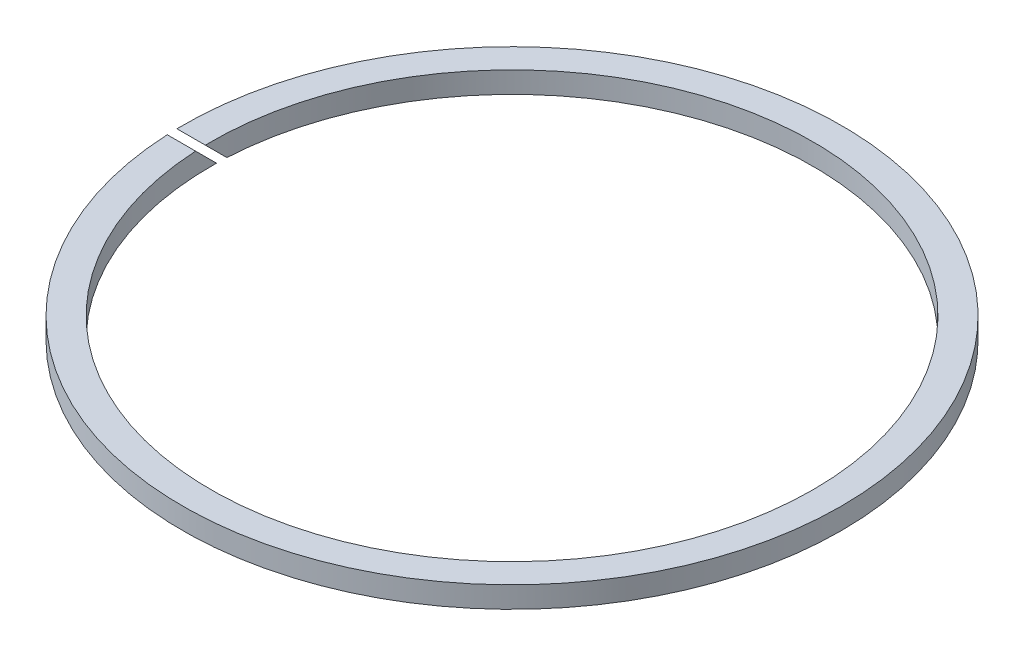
ISO-10303-21;
HEADER;
FILE_DESCRIPTION(('STEP AP214'),'2;1');
FILE_NAME('part.step','',(''),(''),'','','');
FILE_SCHEMA(('AUTOMOTIVE_DESIGN { 1 0 10303 214 1 1 1 1 }'));
ENDSEC;
DATA;
#1=APPLICATION_CONTEXT('core data for automotive mechanical design processes');
#2=APPLICATION_PROTOCOL_DEFINITION('international standard','automotive_design',2000,#1);
#3=PRODUCT_CONTEXT('',#1,'mechanical');
#4=PRODUCT('Part','Part','',(#3));
#5=PRODUCT_RELATED_PRODUCT_CATEGORY('part','',(#4));
#6=PRODUCT_DEFINITION_FORMATION('','',#4);
#7=PRODUCT_DEFINITION_CONTEXT('part definition',#1,'design');
#8=PRODUCT_DEFINITION('design','',#6,#7);
#9=PRODUCT_DEFINITION_SHAPE('','',#8);
#10=(LENGTH_UNIT() NAMED_UNIT(*) SI_UNIT(.MILLI.,.METRE.));
#11=(NAMED_UNIT(*) PLANE_ANGLE_UNIT() SI_UNIT($,.RADIAN.));
#12=(NAMED_UNIT(*) SI_UNIT($,.STERADIAN.) SOLID_ANGLE_UNIT());
#13=UNCERTAINTY_MEASURE_WITH_UNIT(LENGTH_MEASURE(1.E-05),#10,'distance_accuracy_value','');
#14=(GEOMETRIC_REPRESENTATION_CONTEXT(3) GLOBAL_UNCERTAINTY_ASSIGNED_CONTEXT((#13)) GLOBAL_UNIT_ASSIGNED_CONTEXT((#10,
#11,#12)) REPRESENTATION_CONTEXT('',''));
#15=CARTESIAN_POINT('',(0.,0.,0.));
#16=DIRECTION('',(0.,0.,1.));
#17=DIRECTION('',(1.,0.,0.));
#18=AXIS2_PLACEMENT_3D('',#15,#16,#17);
#19=CARTESIAN_POINT('',(0.,1.5,0.));
#20=DIRECTION('',(0.,1.,0.));
#21=DIRECTION('',(0.,0.,1.));
#22=AXIS2_PLACEMENT_3D('',#19,#20,#21);
#23=PLANE('',#22);
#24=DIRECTION('',(-1.,0.,0.));
#25=VECTOR('',#24,1.);
#26=CARTESIAN_POINT('',(-46.501,1.5,2.20710678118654));
#27=LINE('',#26,#25);
#28=CARTESIAN_POINT('',(-42.4426516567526,1.5,2.20710678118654));
#29=VERTEX_POINT('',#28);
#30=CARTESIAN_POINT('',(-46.4475906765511,1.5,2.20710678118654));
#31=VERTEX_POINT('',#30);
#32=EDGE_CURVE('E55',#29,#31,#27,.T.);
#33=ORIENTED_EDGE('',*,*,#32,.T.);
#34=CARTESIAN_POINT('',(0.,1.5,0.));
#35=DIRECTION('',(0.,1.,0.));
#36=DIRECTION('',(0.,0.,1.));
#37=AXIS2_PLACEMENT_3D('',#34,#35,#36);
#38=CIRCLE('',#37,46.5);
#39=CARTESIAN_POINT('',(-46.4932395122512,1.5,0.792893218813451));
#40=VERTEX_POINT('',#39);
#41=EDGE_CURVE('E11',#31,#40,#38,.T.);
#42=ORIENTED_EDGE('',*,*,#41,.T.);
#43=DIRECTION('',(1.,0.,0.));
#44=VECTOR('',#43,1.);
#45=CARTESIAN_POINT('',(-46.501,1.5,0.792893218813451));
#46=LINE('',#45,#44);
#47=CARTESIAN_POINT('',(-42.4926031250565,1.5,0.792893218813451));
#48=VERTEX_POINT('',#47);
#49=EDGE_CURVE('E73',#40,#48,#46,.T.);
#50=ORIENTED_EDGE('',*,*,#49,.T.);
#51=CARTESIAN_POINT('',(0.,1.5,0.));
#52=DIRECTION('',(0.,1.,0.));
#53=DIRECTION('',(0.,0.,1.));
#54=AXIS2_PLACEMENT_3D('',#51,#52,#53);
#55=CIRCLE('',#54,42.5);
#56=EDGE_CURVE('E83',#29,#48,#55,.T.);
#57=ORIENTED_EDGE('',*,*,#56,.F.);
#58=EDGE_LOOP('',(#33,#42,#50,#57));
#59=FACE_BOUND('',#58,.T.);
#60=ADVANCED_FACE('F32',(#59),#23,.T.);
#61=CARTESIAN_POINT('',(0.,-1.5,0.));
#62=DIRECTION('',(0.,1.,0.));
#63=DIRECTION('',(0.,0.,1.));
#64=AXIS2_PLACEMENT_3D('',#61,#62,#63);
#65=PLANE('',#64);
#66=CARTESIAN_POINT('',(0.,-1.5,0.));
#67=DIRECTION('',(0.,1.,0.));
#68=DIRECTION('',(0.,0.,1.));
#69=AXIS2_PLACEMENT_3D('',#66,#67,#68);
#70=CIRCLE('',#69,46.5);
#71=CARTESIAN_POINT('',(-46.4932395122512,-1.5,-0.792893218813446));
#72=VERTEX_POINT('',#71);
#73=CARTESIAN_POINT('',(-46.4475906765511,-1.5,-2.20710678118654));
#74=VERTEX_POINT('',#73);
#75=EDGE_CURVE('E36',#72,#74,#70,.T.);
#76=ORIENTED_EDGE('',*,*,#75,.F.);
#77=DIRECTION('',(-1.,0.,0.));
#78=VECTOR('',#77,1.);
#79=CARTESIAN_POINT('',(-46.501,-1.5,-0.792893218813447));
#80=LINE('',#79,#78);
#81=CARTESIAN_POINT('',(-42.4926031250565,-1.5,-0.792893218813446));
#82=VERTEX_POINT('',#81);
#83=EDGE_CURVE('E96',#82,#72,#80,.T.);
#84=ORIENTED_EDGE('',*,*,#83,.F.);
#85=CARTESIAN_POINT('',(0.,-1.5,0.));
#86=DIRECTION('',(0.,1.,0.));
#87=DIRECTION('',(0.,0.,1.));
#88=AXIS2_PLACEMENT_3D('',#85,#86,#87);
#89=CIRCLE('',#88,42.5);
#90=CARTESIAN_POINT('',(-42.4426516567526,-1.5,-2.20710678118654));
#91=VERTEX_POINT('',#90);
#92=EDGE_CURVE('E88',#82,#91,#89,.T.);
#93=ORIENTED_EDGE('',*,*,#92,.T.);
#94=DIRECTION('',(1.,0.,0.));
#95=VECTOR('',#94,1.);
#96=CARTESIAN_POINT('',(-46.501,-1.5,-2.20710678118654));
#97=LINE('',#96,#95);
#98=EDGE_CURVE('E47',#74,#91,#97,.T.);
#99=ORIENTED_EDGE('',*,*,#98,.F.);
#100=EDGE_LOOP('',(#76,#84,#93,#99));
#101=FACE_BOUND('',#100,.T.);
#102=ADVANCED_FACE('F103',(#101),#65,.F.);
#103=CARTESIAN_POINT('',(0.,1.5,0.));
#104=DIRECTION('',(0.,-1.,0.));
#105=DIRECTION('',(0.,0.,-1.));
#106=AXIS2_PLACEMENT_3D('',#103,#104,#105);
#107=CYLINDRICAL_SURFACE('',#106,46.5);
#108=ORIENTED_EDGE('',*,*,#41,.F.);
#109=CARTESIAN_POINT('',(0.,-0.707106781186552,0.));
#110=DIRECTION('',(0.,-0.707106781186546,0.707106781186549));
#111=DIRECTION('',(0.,-0.707106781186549,-0.707106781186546));
#112=AXIS2_PLACEMENT_3D('',#109,#110,#111);
#113=ELLIPSE('',#112,65.760930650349,46.5);
#114=EDGE_CURVE('E91',#72,#31,#113,.F.);
#115=ORIENTED_EDGE('',*,*,#114,.F.);
#116=ORIENTED_EDGE('',*,*,#75,.T.);
#117=CARTESIAN_POINT('',(0.,0.707106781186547,0.));
#118=DIRECTION('',(0.,0.707106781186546,-0.707106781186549));
#119=DIRECTION('',(0.,-0.707106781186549,-0.707106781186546));
#120=AXIS2_PLACEMENT_3D('',#117,#118,#119);
#121=ELLIPSE('',#120,65.760930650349,46.5);
#122=EDGE_CURVE('E79',#40,#74,#121,.F.);
#123=ORIENTED_EDGE('',*,*,#122,.F.);
#124=EDGE_LOOP('',(#108,#115,#116,#123));
#125=FACE_BOUND('',#124,.T.);
#126=ADVANCED_FACE('F34',(#125),#107,.T.);
#127=CARTESIAN_POINT('',(0.,1.5,0.));
#128=DIRECTION('',(0.,-1.,0.));
#129=DIRECTION('',(0.,0.,-1.));
#130=AXIS2_PLACEMENT_3D('',#127,#128,#129);
#131=CYLINDRICAL_SURFACE('',#130,42.5);
#132=CARTESIAN_POINT('',(0.,-0.707106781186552,0.));
#133=DIRECTION('',(0.,-0.707106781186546,0.707106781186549));
#134=DIRECTION('',(0.,-0.707106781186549,-0.707106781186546));
#135=AXIS2_PLACEMENT_3D('',#132,#133,#134);
#136=ELLIPSE('',#135,60.1040764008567,42.5);
#137=EDGE_CURVE('E85',#82,#29,#136,.F.);
#138=ORIENTED_EDGE('',*,*,#137,.T.);
#139=ORIENTED_EDGE('',*,*,#56,.T.);
#140=CARTESIAN_POINT('',(0.,0.707106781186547,0.));
#141=DIRECTION('',(0.,0.707106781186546,-0.707106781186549));
#142=DIRECTION('',(0.,-0.707106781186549,-0.707106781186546));
#143=AXIS2_PLACEMENT_3D('',#140,#141,#142);
#144=ELLIPSE('',#143,60.1040764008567,42.5);
#145=EDGE_CURVE('E70',#48,#91,#144,.F.);
#146=ORIENTED_EDGE('',*,*,#145,.T.);
#147=ORIENTED_EDGE('',*,*,#92,.F.);
#148=EDGE_LOOP('',(#138,#139,#146,#147));
#149=FACE_BOUND('',#148,.T.);
#150=ADVANCED_FACE('F87',(#149),#131,.F.);
#151=CARTESIAN_POINT('',(-46.501,4.38001871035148,3.67291192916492));
#152=DIRECTION('',(0.,0.707106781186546,-0.707106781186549));
#153=DIRECTION('',(0.,0.707106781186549,0.707106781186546));
#154=AXIS2_PLACEMENT_3D('',#151,#152,#153);
#155=PLANE('',#154);
#156=ORIENTED_EDGE('',*,*,#122,.T.);
#157=ORIENTED_EDGE('',*,*,#98,.T.);
#158=ORIENTED_EDGE('',*,*,#145,.F.);
#159=ORIENTED_EDGE('',*,*,#49,.F.);
#160=EDGE_LOOP('',(#156,#157,#158,#159));
#161=FACE_BOUND('',#160,.T.);
#162=ADVANCED_FACE('F72',(#161),#155,.F.);
#163=CARTESIAN_POINT('',(-46.501,3.67291192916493,4.38001871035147));
#164=DIRECTION('',(0.,-0.707106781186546,0.707106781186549));
#165=DIRECTION('',(0.,-0.707106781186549,-0.707106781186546));
#166=AXIS2_PLACEMENT_3D('',#163,#164,#165);
#167=PLANE('',#166);
#168=ORIENTED_EDGE('',*,*,#114,.T.);
#169=ORIENTED_EDGE('',*,*,#32,.F.);
#170=ORIENTED_EDGE('',*,*,#137,.F.);
#171=ORIENTED_EDGE('',*,*,#83,.T.);
#172=EDGE_LOOP('',(#168,#169,#170,#171));
#173=FACE_BOUND('',#172,.T.);
#174=ADVANCED_FACE('F106',(#173),#167,.F.);
#175=CLOSED_SHELL('',(#60,#102,#126,#150,#162,#174));
#176=MANIFOLD_SOLID_BREP('B2',#175);
#177=ADVANCED_BREP_SHAPE_REPRESENTATION('',(#18,#176),#14);
#178=SHAPE_DEFINITION_REPRESENTATION(#9,#177);
ENDSEC;
END-ISO-10303-21;
